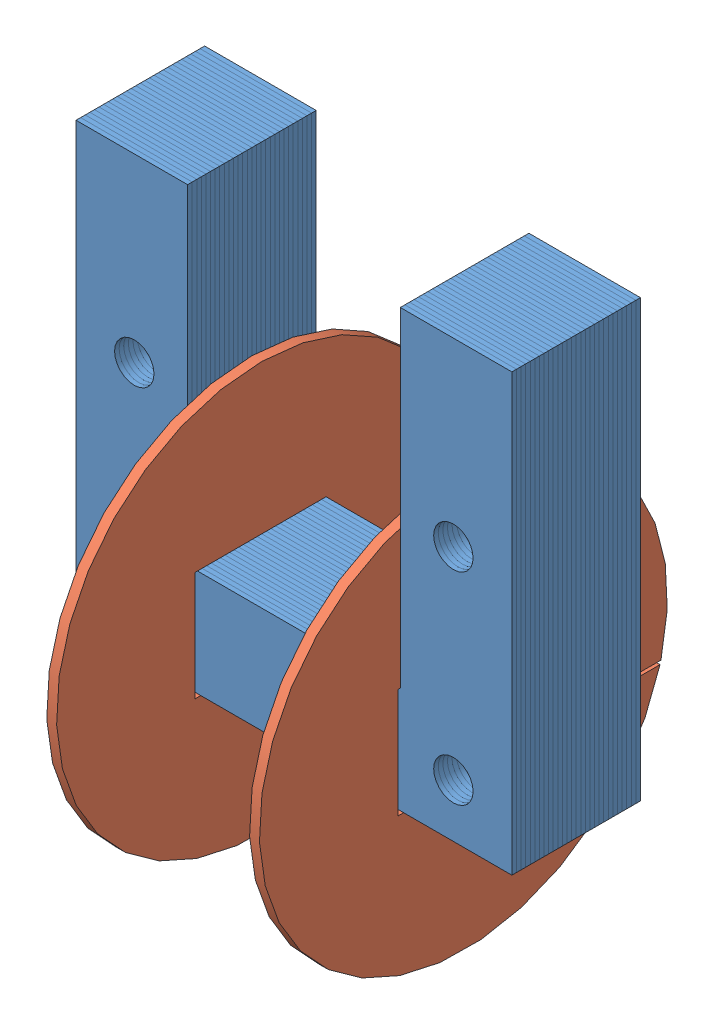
SolidWorks assembly A1003495239.SLDASM, configuration Default (file format 3100). Lengths in mm.
Overall size (32.54 43.94 30.48).
31 component instances, 2 part files, 6 mates.
Components (placement in the parent):
- A3003508238-1: A3003508238.SLDASM [Default] at origin size (32.54 32.54 9.6)
  - A1003524911-1: A1003524911.SLDPRT [Default] at origin size (32.54 32.54 0.34)
  - A1003524911-2: A1003524911.SLDPRT [Default] at (0 0 -0.3429) size (32.54 32.54 0.34)
  - A1003524911-3: A1003524911.SLDPRT [Default] at (0 0 -0.6858) size (32.54 32.54 0.34)
  - A1003524911-4: A1003524911.SLDPRT [Default] at (0 0 -1.0287) size (32.54 32.54 0.34)
  - A1003524911-5: A1003524911.SLDPRT [Default] at (0 0 -1.3716) size (32.54 32.54 0.34)
  - A1003524911-6: A1003524911.SLDPRT [Default] at (0 0 -1.7145) size (32.54 32.54 0.34)
  - A1003524911-7: A1003524911.SLDPRT [Default] at (0 0 -2.0574) size (32.54 32.54 0.34)
  - A1003524911-8: A1003524911.SLDPRT [Default] at (0 0 -2.4003) size (32.54 32.54 0.34)
  - A1003524911-9: A1003524911.SLDPRT [Default] at (0 0 -2.7432) size (32.54 32.54 0.34)
  - A1003524911-10: A1003524911.SLDPRT [Default] at (0 0 -3.0861) size (32.54 32.54 0.34)
  - A1003524911-11: A1003524911.SLDPRT [Default] at (0 0 -3.429) size (32.54 32.54 0.34)
  - A1003524911-12: A1003524911.SLDPRT [Default] at (0 0 -3.7719) size (32.54 32.54 0.34)
  - A1003524911-13: A1003524911.SLDPRT [Default] at (0 0 -4.1148) size (32.54 32.54 0.34)
  - A1003524911-14: A1003524911.SLDPRT [Default] at (0 0 -4.4577) size (32.54 32.54 0.34)
  - A1003524911-15: A1003524911.SLDPRT [Default] at (0 0 -4.8006) size (32.54 32.54 0.34)
  - A1003524911-16: A1003524911.SLDPRT [Default] at (0 0 -5.1435) size (32.54 32.54 0.34)
  - A1003524911-17: A1003524911.SLDPRT [Default] at (0 0 -5.4864) size (32.54 32.54 0.34)
  - A1003524911-18: A1003524911.SLDPRT [Default] at (0 0 -5.8293) size (32.54 32.54 0.34)
  - A1003524911-19: A1003524911.SLDPRT [Default] at (0 0 -6.1722) size (32.54 32.54 0.34)
  - A1003524911-20: A1003524911.SLDPRT [Default] at (0 0 -6.5151) size (32.54 32.54 0.34)
  - A1003524911-21: A1003524911.SLDPRT [Default] at (0 0 -6.858) size (32.54 32.54 0.34)
  - A1003524911-22: A1003524911.SLDPRT [Default] at (0 0 -7.2009) size (32.54 32.54 0.34)
  - A1003524911-23: A1003524911.SLDPRT [Default] at (0 0 -7.5438) size (32.54 32.54 0.34)
  - A1003524911-24: A1003524911.SLDPRT [Default] at (0 0 -7.8867) size (32.54 32.54 0.34)
  - A1003524911-25: A1003524911.SLDPRT [Default] at (0 0 -8.2296) size (32.54 32.54 0.34)
  - A1003524911-26: A1003524911.SLDPRT [Default] at (0 0 -8.5725) size (32.54 32.54 0.34)
  - A1003524911-27: A1003524911.SLDPRT [Default] at (0 0 -8.9154) size (32.54 32.54 0.34)
  - A1003524911-28: A1003524911.SLDPRT [Default] at (0 0 -9.2583) size (32.54 32.54 0.34)
- A1003509912-1: A1003509912.SLDPRT [Default] at (-7.2041 -12.4301 -4.5403) x (0 0 1) z (-1 0 0) size (30.48 30.48 0.74)
- A1003509912-2: A1003509912.SLDPRT [Default] at (7.9407 -12.4301 -4.5403) x (0 0 1) z (-1 0 0) size (30.48 30.48 0.74)
Mates (geometry in assembly coordinates):
- Concentric1: concentric aligned: circle of A1003509912-1 centre (-7.2041 -12.4301 -4.5403) axis (-1 0 0); circle of A1003509912-2 centre (7.9407 -12.4301 -4.5403) axis (-1 0 0)
- Coincident6: coincident aligned: plane of A1003509912-1 through (-7.9407 -16.5195 -9.4298) normal (0 1 0); plane of A1003509912-2 through (7.2041 -16.5195 -9.4298) normal (0 1 0)
- Coincident7: coincident anti-aligned: plane of A3003508238-1/A1003524911-28 through (-16.2719 -16.2719 -9.4298) normal (0 0 -1); plane of A1003509912-1 through (-7.9407 -8.3407 -9.4298) normal (0 0 1)
- Coincident8: coincident anti-aligned: plane of A3003508238-1/A1003524911-28 through (-7.9407 -8.3407 -9.0869) normal (0 1 0); plane of A1003509912-1 through (-7.9407 -8.3407 -9.4298) normal (0 -1 0)
- Coincident9: coincident anti-aligned: plane of A3003508238-1/A1003524911-28 through (-7.9407 16.2719 -9.0869) normal (1 0 0); plane of A1003509912-1 through (-7.9407 -12.4301 -4.5403) normal (-1 0 0)
- Coincident10: coincident anti-aligned: plane of A3003508238-1/A1003524911-28 through (7.9407 16.2719 -9.0869) normal (-1 0 0); plane of A1003509912-2 through (7.9407 -12.4301 -4.5403) normal (1 0 0)
